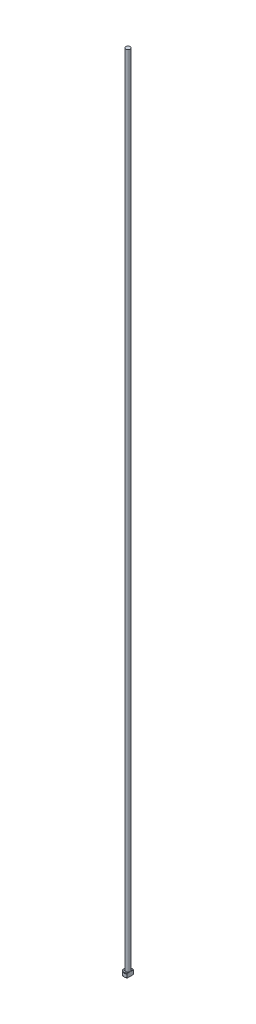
ISO-10303-21;
HEADER;
FILE_DESCRIPTION(('STEP AP214'),'2;1');
FILE_NAME('part.step','',(''),(''),'','','');
FILE_SCHEMA(('AUTOMOTIVE_DESIGN { 1 0 10303 214 1 1 1 1 }'));
ENDSEC;
DATA;
#1=APPLICATION_CONTEXT('core data for automotive mechanical design processes');
#2=APPLICATION_PROTOCOL_DEFINITION('international standard','automotive_design',2000,#1);
#3=PRODUCT_CONTEXT('',#1,'mechanical');
#4=PRODUCT('Part','Part','',(#3));
#5=PRODUCT_RELATED_PRODUCT_CATEGORY('part','',(#4));
#6=PRODUCT_DEFINITION_FORMATION('','',#4);
#7=PRODUCT_DEFINITION_CONTEXT('part definition',#1,'design');
#8=PRODUCT_DEFINITION('design','',#6,#7);
#9=PRODUCT_DEFINITION_SHAPE('','',#8);
#10=(LENGTH_UNIT() NAMED_UNIT(*) SI_UNIT(.MILLI.,.METRE.));
#11=(NAMED_UNIT(*) PLANE_ANGLE_UNIT() SI_UNIT($,.RADIAN.));
#12=(NAMED_UNIT(*) SI_UNIT($,.STERADIAN.) SOLID_ANGLE_UNIT());
#13=UNCERTAINTY_MEASURE_WITH_UNIT(LENGTH_MEASURE(1.E-05),#10,'distance_accuracy_value','');
#14=(GEOMETRIC_REPRESENTATION_CONTEXT(3) GLOBAL_UNCERTAINTY_ASSIGNED_CONTEXT((#13)) GLOBAL_UNIT_ASSIGNED_CONTEXT((#10,
#11,#12)) REPRESENTATION_CONTEXT('',''));
#15=CARTESIAN_POINT('',(0.,0.,0.));
#16=DIRECTION('',(0.,0.,1.));
#17=DIRECTION('',(1.,0.,0.));
#18=AXIS2_PLACEMENT_3D('',#15,#16,#17);
#19=CARTESIAN_POINT('',(0.,0.,0.));
#20=DIRECTION('',(0.,-1.,0.));
#21=DIRECTION('',(0.,0.,-1.));
#22=AXIS2_PLACEMENT_3D('',#19,#20,#21);
#23=PLANE('',#22);
#24=CARTESIAN_POINT('',(0.,0.,0.));
#25=DIRECTION('',(0.,-1.,0.));
#26=DIRECTION('',(0.,0.,-1.));
#27=AXIS2_PLACEMENT_3D('',#24,#25,#26);
#28=CIRCLE('',#27,1.80000000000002);
#29=CARTESIAN_POINT('',(1.09999999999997,0.,1.42478068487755));
#30=VERTEX_POINT('',#29);
#31=CARTESIAN_POINT('',(1.09999999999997,0.,-1.42478068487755));
#32=VERTEX_POINT('',#31);
#33=EDGE_CURVE('E98',#30,#32,#28,.T.);
#34=ORIENTED_EDGE('',*,*,#33,.T.);
#35=DIRECTION('',(0.,0.,1.));
#36=VECTOR('',#35,1.);
#37=CARTESIAN_POINT('',(1.09999999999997,0.,-1.67032930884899));
#38=LINE('',#37,#36);
#39=EDGE_CURVE('E83',#32,#30,#38,.T.);
#40=ORIENTED_EDGE('',*,*,#39,.T.);
#41=EDGE_LOOP('',(#34,#40));
#42=FACE_BOUND('',#41,.T.);
#43=ADVANCED_FACE('F32',(#42),#23,.T.);
#44=CARTESIAN_POINT('',(0.,259.958771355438,0.));
#45=DIRECTION('',(0.,1.,0.));
#46=DIRECTION('',(0.,0.,1.));
#47=AXIS2_PLACEMENT_3D('',#44,#45,#46);
#48=CYLINDRICAL_SURFACE('',#47,1.99999999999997);
#49=CARTESIAN_POINT('',(0.,1.79999999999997,0.));
#50=DIRECTION('',(0.,1.,0.));
#51=DIRECTION('',(0.,0.,1.));
#52=AXIS2_PLACEMENT_3D('',#49,#50,#51);
#53=CIRCLE('',#52,1.99999999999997);
#54=CARTESIAN_POINT('',(1.09999999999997,1.79999999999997,1.67032930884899));
#55=VERTEX_POINT('',#54);
#56=CARTESIAN_POINT('',(1.09999999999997,1.79999999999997,-1.67032930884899));
#57=VERTEX_POINT('',#56);
#58=EDGE_CURVE('E104',#55,#57,#53,.F.);
#59=ORIENTED_EDGE('',*,*,#58,.T.);
#60=DIRECTION('',(0.,-1.,0.));
#61=VECTOR('',#60,1.);
#62=CARTESIAN_POINT('',(1.09999999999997,400.,-1.67032930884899));
#63=LINE('',#62,#61);
#64=CARTESIAN_POINT('',(1.09999999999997,0.199999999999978,-1.67032930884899));
#65=VERTEX_POINT('',#64);
#66=EDGE_CURVE('E183',#57,#65,#63,.T.);
#67=ORIENTED_EDGE('',*,*,#66,.T.);
#68=CARTESIAN_POINT('',(0.,0.199999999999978,0.));
#69=DIRECTION('',(0.,-1.,0.));
#70=DIRECTION('',(0.,0.,-1.));
#71=AXIS2_PLACEMENT_3D('',#68,#69,#70);
#72=CIRCLE('',#71,1.99999999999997);
#73=CARTESIAN_POINT('',(1.09999999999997,0.199999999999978,1.67032930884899));
#74=VERTEX_POINT('',#73);
#75=EDGE_CURVE('E100',#65,#74,#72,.F.);
#76=ORIENTED_EDGE('',*,*,#75,.T.);
#77=DIRECTION('',(0.,-1.,0.));
#78=VECTOR('',#77,1.);
#79=CARTESIAN_POINT('',(1.09999999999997,400.,1.67032930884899));
#80=LINE('',#79,#78);
#81=EDGE_CURVE('E93',#55,#74,#80,.T.);
#82=ORIENTED_EDGE('',*,*,#81,.F.);
#83=EDGE_LOOP('',(#59,#67,#76,#82));
#84=FACE_BOUND('',#83,.T.);
#85=ADVANCED_FACE('F158',(#84),#48,.T.);
#86=CARTESIAN_POINT('',(-1.99999999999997,2.,0.));
#87=DIRECTION('',(0.,1.,0.));
#88=DIRECTION('',(0.,0.,1.));
#89=AXIS2_PLACEMENT_3D('',#86,#87,#88);
#90=PLANE('',#89);
#91=CARTESIAN_POINT('',(0.,2.,0.));
#92=DIRECTION('',(0.,1.,0.));
#93=DIRECTION('',(0.,0.,1.));
#94=AXIS2_PLACEMENT_3D('',#91,#92,#93);
#95=CIRCLE('',#94,1.79999999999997);
#96=CARTESIAN_POINT('',(1.09999999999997,2.,-1.42478068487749));
#97=VERTEX_POINT('',#96);
#98=CARTESIAN_POINT('',(1.09999999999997,2.,1.42478068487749));
#99=VERTEX_POINT('',#98);
#100=EDGE_CURVE('E178',#97,#99,#95,.T.);
#101=ORIENTED_EDGE('',*,*,#100,.T.);
#102=DIRECTION('',(0.,0.,-1.));
#103=VECTOR('',#102,1.);
#104=CARTESIAN_POINT('',(1.09999999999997,2.,0.));
#105=LINE('',#104,#103);
#106=CARTESIAN_POINT('',(1.09999999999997,1.99999999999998,0.692820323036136));
#107=VERTEX_POINT('',#106);
#108=EDGE_CURVE('E57',#99,#107,#105,.T.);
#109=ORIENTED_EDGE('',*,*,#108,.T.);
#110=CARTESIAN_POINT('',(0.,2.,0.));
#111=DIRECTION('',(0.,1.,0.));
#112=DIRECTION('',(0.,0.,1.));
#113=AXIS2_PLACEMENT_3D('',#110,#111,#112);
#114=CIRCLE('',#113,1.29999999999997);
#115=CARTESIAN_POINT('',(1.09999999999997,1.99999999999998,-0.692820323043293));
#116=VERTEX_POINT('',#115);
#117=EDGE_CURVE('E107',#107,#116,#114,.F.);
#118=ORIENTED_EDGE('',*,*,#117,.T.);
#119=EDGE_CURVE('E136',#116,#97,#105,.T.);
#120=ORIENTED_EDGE('',*,*,#119,.T.);
#121=EDGE_LOOP('',(#101,#109,#118,#120));
#122=FACE_BOUND('',#121,.T.);
#123=ADVANCED_FACE('F147',(#122),#90,.T.);
#124=CARTESIAN_POINT('',(0.,2.,0.));
#125=DIRECTION('',(0.,-1.,0.));
#126=DIRECTION('',(0.,0.,-1.));
#127=AXIS2_PLACEMENT_3D('',#124,#125,#126);
#128=CONICAL_SURFACE('',#127,1.79999999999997,0.785398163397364);
#129=ORIENTED_EDGE('',*,*,#58,.F.);
#130=CARTESIAN_POINT('',(1.09999999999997,-0.0394609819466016,3.67851337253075));
#131=CARTESIAN_POINT('',(1.09999999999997,0.0938871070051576,3.53927086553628));
#132=CARTESIAN_POINT('',(1.09999999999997,0.226969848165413,3.39976850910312));
#133=CARTESIAN_POINT('',(1.09999999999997,0.492235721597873,3.11984283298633));
#134=CARTESIAN_POINT('',(1.09999999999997,0.624418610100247,2.97941928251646));
#135=CARTESIAN_POINT('',(1.09999999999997,0.887405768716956,2.69736523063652));
#136=CARTESIAN_POINT('',(1.09999999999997,1.01821044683,2.55573511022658));
#137=CARTESIAN_POINT('',(1.09999999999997,1.27771059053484,2.27057337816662));
#138=CARTESIAN_POINT('',(1.09999999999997,1.40640632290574,2.12704201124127));
#139=CARTESIAN_POINT('',(1.09999999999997,1.59274008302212,1.91391242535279));
#140=CARTESIAN_POINT('',(1.09999999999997,1.6517969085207,1.84555665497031));
#141=CARTESIAN_POINT('',(1.09999999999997,1.7688312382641,1.70791335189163));
#142=CARTESIAN_POINT('',(1.09999999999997,1.82680864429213,1.63862573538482));
#143=CARTESIAN_POINT('',(1.09999999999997,1.94139081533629,1.49868129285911));
#144=CARTESIAN_POINT('',(1.09999999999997,1.99799249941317,1.42802193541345));
#145=CARTESIAN_POINT('',(1.09999999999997,2.10905321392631,1.28504453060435));
#146=CARTESIAN_POINT('',(1.09999999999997,2.16351265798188,1.21272680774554));
#147=CARTESIAN_POINT('',(1.09999999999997,2.25351962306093,1.08760351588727));
#148=CARTESIAN_POINT('',(1.09999999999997,2.28987864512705,1.03538457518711));
#149=CARTESIAN_POINT('',(1.09999999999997,2.36041465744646,0.929499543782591));
#150=CARTESIAN_POINT('',(1.09999999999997,2.39459216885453,0.875833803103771));
#151=CARTESIAN_POINT('',(1.09999999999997,2.45984644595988,0.766757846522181));
#152=CARTESIAN_POINT('',(1.09999999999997,2.49092891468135,0.711351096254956));
#153=CARTESIAN_POINT('',(1.09999999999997,2.54873716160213,0.598347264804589));
#154=CARTESIAN_POINT('',(1.09999999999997,2.57546692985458,0.540752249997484));
#155=CARTESIAN_POINT('',(1.09999999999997,2.6253167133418,0.416467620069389));
#156=CARTESIAN_POINT('',(1.09999999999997,2.6477191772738,0.349473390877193));
#157=CARTESIAN_POINT('',(1.09999999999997,2.67308404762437,0.247046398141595));
#158=CARTESIAN_POINT('',(1.09999999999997,2.68016204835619,0.212626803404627));
#159=CARTESIAN_POINT('',(1.09999999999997,2.69123178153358,0.143302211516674));
#160=CARTESIAN_POINT('',(1.09999999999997,2.69522514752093,0.108397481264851));
#161=CARTESIAN_POINT('',(1.09999999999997,2.69990666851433,0.0380394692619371));
#162=CARTESIAN_POINT('',(1.09999999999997,2.70056409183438,0.00258409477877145));
#163=CARTESIAN_POINT('',(1.09999999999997,2.69845711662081,-0.0682167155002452));
#164=CARTESIAN_POINT('',(1.09999999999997,2.69569269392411,-0.103562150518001));
#165=CARTESIAN_POINT('',(1.09999999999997,2.68246916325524,-0.209100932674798));
#166=CARTESIAN_POINT('',(1.09999999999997,2.66707429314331,-0.278705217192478));
#167=CARTESIAN_POINT('',(1.09999999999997,2.6311290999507,-0.398409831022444));
#168=CARTESIAN_POINT('',(1.09999999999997,2.61268926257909,-0.44919688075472));
#169=CARTESIAN_POINT('',(1.09999999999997,2.57144771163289,-0.548998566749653));
#170=CARTESIAN_POINT('',(1.09999999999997,2.54864260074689,-0.5980117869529));
#171=CARTESIAN_POINT('',(1.09999999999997,2.49970814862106,-0.694626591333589));
#172=CARTESIAN_POINT('',(1.09999999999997,2.47356275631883,-0.742219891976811));
#173=CARTESIAN_POINT('',(1.09999999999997,2.41890398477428,-0.835986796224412));
#174=CARTESIAN_POINT('',(1.09999999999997,2.3903915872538,-0.882160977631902));
#175=CARTESIAN_POINT('',(1.09999999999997,2.32625511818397,-0.981643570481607));
#176=CARTESIAN_POINT('',(1.09999999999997,2.29028006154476,-1.0347242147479));
#177=CARTESIAN_POINT('',(1.09999999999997,2.21653305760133,-1.13962743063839));
#178=CARTESIAN_POINT('',(1.09999999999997,2.17876074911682,-1.19144974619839));
#179=CARTESIAN_POINT('',(1.09999999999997,2.06341857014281,-1.34551007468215));
#180=CARTESIAN_POINT('',(1.09999999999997,1.98387469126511,-1.44626517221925));
#181=CARTESIAN_POINT('',(1.09999999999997,1.82152847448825,-1.64549240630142));
#182=CARTESIAN_POINT('',(1.09999999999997,1.73871851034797,-1.74395822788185));
#183=CARTESIAN_POINT('',(1.09999999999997,1.57115072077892,-1.93914128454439));
#184=CARTESIAN_POINT('',(1.09999999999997,1.48639373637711,-2.03585924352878));
#185=CARTESIAN_POINT('',(1.09999999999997,1.31545903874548,-2.22820182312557));
#186=CARTESIAN_POINT('',(1.09999999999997,1.22927997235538,-2.32382523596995));
#187=CARTESIAN_POINT('',(1.09999999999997,1.05596320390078,-2.51421569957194));
#188=CARTESIAN_POINT('',(1.09999999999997,0.968825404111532,-2.60898266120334));
#189=CARTESIAN_POINT('',(1.09999999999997,0.706597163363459,-2.89210208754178));
#190=CARTESIAN_POINT('',(1.09999999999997,0.530482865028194,-3.0795054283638));
#191=CARTESIAN_POINT('',(1.09999999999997,0.288219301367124,-3.33512571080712));
#192=CARTESIAN_POINT('',(1.09999999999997,0.222748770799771,-3.40399021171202));
#193=CARTESIAN_POINT('',(1.09999999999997,0.0917246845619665,-3.54143252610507));
#194=CARTESIAN_POINT('',(1.09999999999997,0.026171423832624,-3.61001062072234));
#195=CARTESIAN_POINT('',(1.09999999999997,-0.0394609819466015,-3.67851337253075));
#196=B_SPLINE_CURVE_WITH_KNOTS('',3,(#130,#131,#132,#133,#134,#135,#136,#137,#138,#139,#140,
#141,#142,#143,#144,#145,#146,#147,#148,#149,#150,#151,#152,#153,#154,#155,#156,#157,#158,#159,
#160,#161,#162,#163,#164,#165,#166,#167,#168,#169,#170,#171,#172,#173,#174,#175,#176,#177,#178,
#179,#180,#181,#182,#183,#184,#185,#186,#187,#188,#189,#190,#191,#192,#193,#194,#195),
.UNSPECIFIED.,.F.,.F.,(4,2,2,2,2,2,2,2,2,2,2,2,2,2,2,2,2,2,2,2,2,2,2,2,2,2,2,2,2,2,2,2,4),(0.,
0.578393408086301,1.1569377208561,1.73530565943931,2.31359986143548,2.58459381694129,
2.8556123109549,3.12719032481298,3.39871564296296,3.58956709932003,3.78037278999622,
3.97082012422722,4.1610918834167,4.37223430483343,4.47753596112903,4.58278181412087,
4.68899548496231,4.7952099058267,5.00790932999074,5.16979123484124,5.33179964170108,
5.49461809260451,5.65736934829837,5.84968611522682,6.04204169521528,6.42702818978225,
6.8129740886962,7.19875629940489,7.58492959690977,7.97114262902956,8.74263124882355,
9.0276899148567,9.31229787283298),.UNSPECIFIED.);
#197=EDGE_CURVE('E135',#55,#99,#196,.T.);
#198=ORIENTED_EDGE('',*,*,#197,.T.);
#199=ORIENTED_EDGE('',*,*,#100,.F.);
#200=EDGE_CURVE('E127',#97,#57,#196,.T.);
#201=ORIENTED_EDGE('',*,*,#200,.T.);
#202=EDGE_LOOP('',(#129,#198,#199,#201));
#203=FACE_BOUND('',#202,.T.);
#204=ADVANCED_FACE('F143',(#203),#128,.T.);
#205=CARTESIAN_POINT('',(0.,0.199999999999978,0.));
#206=DIRECTION('',(0.,1.,0.));
#207=DIRECTION('',(0.,0.,1.));
#208=AXIS2_PLACEMENT_3D('',#205,#206,#207);
#209=CONICAL_SURFACE('',#208,1.99999999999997,0.785398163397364);
#210=ORIENTED_EDGE('',*,*,#75,.F.);
#211=CARTESIAN_POINT('',(1.09999999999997,2.03946098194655,-3.67851337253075));
#212=CARTESIAN_POINT('',(1.09999999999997,1.90611289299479,-3.53927086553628));
#213=CARTESIAN_POINT('',(1.09999999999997,1.77303015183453,-3.39976850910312));
#214=CARTESIAN_POINT('',(1.09999999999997,1.50776427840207,-3.11984283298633));
#215=CARTESIAN_POINT('',(1.09999999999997,1.3755813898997,-2.97941928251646));
#216=CARTESIAN_POINT('',(1.09999999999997,1.11259423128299,-2.69736523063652));
#217=CARTESIAN_POINT('',(1.09999999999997,0.981789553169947,-2.55573511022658));
#218=CARTESIAN_POINT('',(1.09999999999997,0.722289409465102,-2.27057337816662));
#219=CARTESIAN_POINT('',(1.09999999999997,0.593593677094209,-2.12704201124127));
#220=CARTESIAN_POINT('',(1.09999999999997,0.407259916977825,-1.91391242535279));
#221=CARTESIAN_POINT('',(1.09999999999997,0.348203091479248,-1.84555665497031));
#222=CARTESIAN_POINT('',(1.09999999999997,0.231168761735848,-1.70791335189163));
#223=CARTESIAN_POINT('',(1.09999999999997,0.173191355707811,-1.63862573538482));
#224=CARTESIAN_POINT('',(1.09999999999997,0.058609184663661,-1.49868129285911));
#225=CARTESIAN_POINT('',(1.09999999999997,0.00200750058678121,-1.42802193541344));
#226=CARTESIAN_POINT('',(1.09999999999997,-0.109053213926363,-1.28504453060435));
#227=CARTESIAN_POINT('',(1.09999999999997,-0.16351265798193,-1.21272680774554));
#228=CARTESIAN_POINT('',(1.09999999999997,-0.253519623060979,-1.08760351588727));
#229=CARTESIAN_POINT('',(1.09999999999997,-0.289878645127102,-1.03538457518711));
#230=CARTESIAN_POINT('',(1.09999999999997,-0.360414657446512,-0.929499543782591));
#231=CARTESIAN_POINT('',(1.09999999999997,-0.394592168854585,-0.875833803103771));
#232=CARTESIAN_POINT('',(1.09999999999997,-0.45984644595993,-0.766757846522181));
#233=CARTESIAN_POINT('',(1.09999999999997,-0.4909289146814,-0.711351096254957));
#234=CARTESIAN_POINT('',(1.09999999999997,-0.548737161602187,-0.59834726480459));
#235=CARTESIAN_POINT('',(1.09999999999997,-0.575466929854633,-0.540752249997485));
#236=CARTESIAN_POINT('',(1.09999999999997,-0.625316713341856,-0.41646762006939));
#237=CARTESIAN_POINT('',(1.09999999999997,-0.647719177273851,-0.349473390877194));
#238=CARTESIAN_POINT('',(1.09999999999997,-0.673084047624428,-0.247046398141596));
#239=CARTESIAN_POINT('',(1.09999999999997,-0.680162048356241,-0.212626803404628));
#240=CARTESIAN_POINT('',(1.09999999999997,-0.691231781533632,-0.143302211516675));
#241=CARTESIAN_POINT('',(1.09999999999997,-0.69522514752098,-0.108397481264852));
#242=CARTESIAN_POINT('',(1.09999999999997,-0.699906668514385,-0.0380394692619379));
#243=CARTESIAN_POINT('',(1.09999999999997,-0.700564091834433,-0.00258409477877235));
#244=CARTESIAN_POINT('',(1.09999999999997,-0.69845711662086,0.0682167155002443));
#245=CARTESIAN_POINT('',(1.09999999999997,-0.695692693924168,0.103562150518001));
#246=CARTESIAN_POINT('',(1.09999999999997,-0.682469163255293,0.209100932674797));
#247=CARTESIAN_POINT('',(1.09999999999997,-0.667074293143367,0.278705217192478));
#248=CARTESIAN_POINT('',(1.09999999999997,-0.631129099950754,0.398409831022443));
#249=CARTESIAN_POINT('',(1.09999999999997,-0.612689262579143,0.449196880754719));
#250=CARTESIAN_POINT('',(1.09999999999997,-0.571447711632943,0.548998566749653));
#251=CARTESIAN_POINT('',(1.09999999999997,-0.548642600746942,0.5980117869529));
#252=CARTESIAN_POINT('',(1.09999999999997,-0.499708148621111,0.694626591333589));
#253=CARTESIAN_POINT('',(1.09999999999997,-0.473562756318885,0.74221989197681));
#254=CARTESIAN_POINT('',(1.09999999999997,-0.418903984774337,0.83598679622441));
#255=CARTESIAN_POINT('',(1.09999999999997,-0.390391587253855,0.8821609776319));
#256=CARTESIAN_POINT('',(1.09999999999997,-0.32625511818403,0.981643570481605));
#257=CARTESIAN_POINT('',(1.09999999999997,-0.290280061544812,1.0347242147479));
#258=CARTESIAN_POINT('',(1.09999999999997,-0.216533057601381,1.13962743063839));
#259=CARTESIAN_POINT('',(1.09999999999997,-0.178760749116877,1.19144974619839));
#260=CARTESIAN_POINT('',(1.09999999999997,-0.0634185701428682,1.34551007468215));
#261=CARTESIAN_POINT('',(1.09999999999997,0.0161253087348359,1.44626517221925));
#262=CARTESIAN_POINT('',(1.09999999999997,0.178471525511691,1.64549240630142));
#263=CARTESIAN_POINT('',(1.09999999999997,0.261281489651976,1.74395822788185));
#264=CARTESIAN_POINT('',(1.09999999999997,0.428849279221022,1.93914128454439));
#265=CARTESIAN_POINT('',(1.09999999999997,0.513606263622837,2.03585924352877));
#266=CARTESIAN_POINT('',(1.09999999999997,0.684540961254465,2.22820182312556));
#267=CARTESIAN_POINT('',(1.09999999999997,0.770720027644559,2.32382523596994));
#268=CARTESIAN_POINT('',(1.09999999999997,0.944036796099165,2.51421569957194));
#269=CARTESIAN_POINT('',(1.09999999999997,1.03117459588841,2.60898266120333));
#270=CARTESIAN_POINT('',(1.09999999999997,1.29340283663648,2.89210208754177));
#271=CARTESIAN_POINT('',(1.09999999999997,1.46951713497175,3.07950542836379));
#272=CARTESIAN_POINT('',(1.09999999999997,1.71178069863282,3.33512571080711));
#273=CARTESIAN_POINT('',(1.09999999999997,1.77725122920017,3.40399021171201));
#274=CARTESIAN_POINT('',(1.09999999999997,1.90827531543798,3.54143252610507));
#275=CARTESIAN_POINT('',(1.09999999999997,1.97382857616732,3.61001062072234));
#276=CARTESIAN_POINT('',(1.09999999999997,2.03946098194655,3.67851337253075));
#277=B_SPLINE_CURVE_WITH_KNOTS('',3,(#211,#212,#213,#214,#215,#216,#217,#218,#219,#220,#221,
#222,#223,#224,#225,#226,#227,#228,#229,#230,#231,#232,#233,#234,#235,#236,#237,#238,#239,#240,
#241,#242,#243,#244,#245,#246,#247,#248,#249,#250,#251,#252,#253,#254,#255,#256,#257,#258,#259,
#260,#261,#262,#263,#264,#265,#266,#267,#268,#269,#270,#271,#272,#273,#274,#275,#276),
.UNSPECIFIED.,.F.,.F.,(4,2,2,2,2,2,2,2,2,2,2,2,2,2,2,2,2,2,2,2,2,2,2,2,2,2,2,2,2,2,2,2,4),(0.,
0.578393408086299,1.1569377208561,1.73530565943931,2.31359986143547,2.58459381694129,
2.8556123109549,3.12719032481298,3.39871564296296,3.58956709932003,3.78037278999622,
3.97082012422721,4.1610918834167,4.37223430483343,4.47753596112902,4.58278181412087,
4.6889954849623,4.79520990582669,5.00790932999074,5.16979123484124,5.33179964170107,
5.4946180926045,5.65736934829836,5.84968611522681,6.04204169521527,6.42702818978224,
6.81297408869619,7.19875629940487,7.58492959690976,7.97114262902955,8.74263124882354,
9.02768991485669,9.31229787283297),.UNSPECIFIED.);
#278=EDGE_CURVE('E86',#65,#32,#277,.T.);
#279=ORIENTED_EDGE('',*,*,#278,.T.);
#280=ORIENTED_EDGE('',*,*,#33,.F.);
#281=EDGE_CURVE('E89',#30,#74,#277,.T.);
#282=ORIENTED_EDGE('',*,*,#281,.T.);
#283=EDGE_LOOP('',(#210,#279,#280,#282));
#284=FACE_BOUND('',#283,.T.);
#285=ADVANCED_FACE('F97',(#284),#209,.T.);
#286=CARTESIAN_POINT('',(0.,2.19999999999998,0.));
#287=DIRECTION('',(0.,1.,0.));
#288=DIRECTION('',(0.,0.,1.));
#289=AXIS2_PLACEMENT_3D('',#286,#287,#288);
#290=TOROIDAL_SURFACE('',#289,1.29999999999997,0.2);
#291=CARTESIAN_POINT('',(1.09999999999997,2.19999999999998,0.));
#292=CARTESIAN_POINT('',(1.09999999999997,2.20000051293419,3.6073967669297E-11));
#293=CARTESIAN_POINT('',(1.09999999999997,2.20000102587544,-9.99111383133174E-08));
#294=CARTESIAN_POINT('',(1.09999999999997,2.20000201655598,-4.21307805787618E-07));
#295=CARTESIAN_POINT('',(1.09999999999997,2.20000249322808,-6.45471450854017E-07));
#296=CARTESIAN_POINT('',(1.09999999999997,2.20000344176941,-1.18549609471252E-06));
#297=CARTESIAN_POINT('',(1.09999999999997,2.20000391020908,-1.50725452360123E-06));
#298=CARTESIAN_POINT('',(1.09999999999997,2.20000479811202,-2.20431303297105E-06));
#299=CARTESIAN_POINT('',(1.09999999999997,2.20000521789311,-2.5792253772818E-06));
#300=CARTESIAN_POINT('',(1.09999999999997,2.2000066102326,-3.91337800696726E-06));
#301=CARTESIAN_POINT('',(1.09999999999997,2.20000751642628,-4.94273423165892E-06));
#302=CARTESIAN_POINT('',(1.09999999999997,2.20000914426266,-7.08045055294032E-06));
#303=CARTESIAN_POINT('',(1.09999999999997,2.20000987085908,-8.18525581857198E-06));
#304=CARTESIAN_POINT('',(1.09999999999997,2.20001256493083,-1.24548986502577E-05));
#305=CARTESIAN_POINT('',(1.09999999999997,2.20001438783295,-1.57147536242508E-05));
#306=CARTESIAN_POINT('',(1.09999999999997,2.20001740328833,-2.21764542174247E-05));
#307=CARTESIAN_POINT('',(1.09999999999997,2.20001863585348,-2.53602841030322E-05));
#308=CARTESIAN_POINT('',(1.09999999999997,2.20002381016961,-3.88057522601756E-05));
#309=CARTESIAN_POINT('',(1.09999999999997,2.20002769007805,-4.90846952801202E-05));
#310=CARTESIAN_POINT('',(1.09999999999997,2.20003398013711,-6.83950902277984E-05));
#311=CARTESIAN_POINT('',(1.09999999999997,2.2000365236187,-7.73813874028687E-05));
#312=CARTESIAN_POINT('',(1.09999999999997,2.20005650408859,-0.000142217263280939));
#313=CARTESIAN_POINT('',(1.09999999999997,2.2000817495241,-0.000195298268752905));
#314=CARTESIAN_POINT('',(1.09999999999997,2.20017599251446,-0.00040106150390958));
#315=CARTESIAN_POINT('',(1.09999999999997,2.20023918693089,-0.000555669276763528));
#316=CARTESIAN_POINT('',(1.09999999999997,2.20048725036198,-0.00115356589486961));
#317=CARTESIAN_POINT('',(1.09999999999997,2.20067820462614,-0.00159487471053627));
#318=CARTESIAN_POINT('',(1.09999999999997,2.20145114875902,-0.00338993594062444));
#319=CARTESIAN_POINT('',(1.09999999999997,2.20202628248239,-0.00474587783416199));
#320=CARTESIAN_POINT('',(1.09999999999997,2.20972642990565,-0.0228890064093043));
#321=CARTESIAN_POINT('',(1.09999999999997,2.21689763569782,-0.0396618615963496));
#322=CARTESIAN_POINT('',(1.09999999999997,2.23088776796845,-0.0726432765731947));
#323=CARTESIAN_POINT('',(1.09999999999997,2.23771010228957,-0.0888504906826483));
#324=CARTESIAN_POINT('',(1.09999999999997,2.2520105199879,-0.12316170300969));
#325=CARTESIAN_POINT('',(1.09999999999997,2.25947482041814,-0.141271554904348));
#326=CARTESIAN_POINT('',(1.09999999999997,2.27424285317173,-0.177765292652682));
#327=CARTESIAN_POINT('',(1.09999999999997,2.28154426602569,-0.196150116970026));
#328=CARTESIAN_POINT('',(1.09999999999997,2.29932484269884,-0.242089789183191));
#329=CARTESIAN_POINT('',(1.09999999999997,2.30960714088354,-0.269721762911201));
#330=CARTESIAN_POINT('',(1.09999999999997,2.32891385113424,-0.324725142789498));
#331=CARTESIAN_POINT('',(1.09999999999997,2.33796145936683,-0.352088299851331));
#332=CARTESIAN_POINT('',(1.09999999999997,2.35364474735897,-0.40369058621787));
#333=CARTESIAN_POINT('',(1.09999999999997,2.36044093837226,-0.427880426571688));
#334=CARTESIAN_POINT('',(1.09999999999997,2.37278398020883,-0.47674569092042));
#335=CARTESIAN_POINT('',(1.09999999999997,2.37832261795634,-0.501423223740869));
#336=CARTESIAN_POINT('',(1.09999999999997,2.38801040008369,-0.552403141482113));
#337=CARTESIAN_POINT('',(1.09999999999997,2.39207120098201,-0.578722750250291));
#338=CARTESIAN_POINT('',(1.09999999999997,2.39789224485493,-0.631611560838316));
#339=CARTESIAN_POINT('',(1.09999999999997,2.39965448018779,-0.658180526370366));
#340=CARTESIAN_POINT('',(1.09999999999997,2.40018565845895,-0.705278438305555));
#341=CARTESIAN_POINT('',(1.09999999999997,2.39954710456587,-0.725798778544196));
#342=CARTESIAN_POINT('',(1.09999999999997,2.39616992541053,-0.766506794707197));
#343=CARTESIAN_POINT('',(1.09999999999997,2.39344923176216,-0.786695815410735));
#344=CARTESIAN_POINT('',(1.09999999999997,2.38541819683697,-0.826869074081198));
#345=CARTESIAN_POINT('',(1.09999999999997,2.38007173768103,-0.846846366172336));
#346=CARTESIAN_POINT('',(1.09999999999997,2.36615936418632,-0.885705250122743));
#347=CARTESIAN_POINT('',(1.09999999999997,2.35759666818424,-0.904587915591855));
#348=CARTESIAN_POINT('',(1.09999999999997,2.3413093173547,-0.932102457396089));
#349=CARTESIAN_POINT('',(1.09999999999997,2.33493263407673,-0.94153212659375));
#350=CARTESIAN_POINT('',(1.09999999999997,2.32089802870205,-0.959389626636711));
#351=CARTESIAN_POINT('',(1.09999999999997,2.31324176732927,-0.967818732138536));
#352=CARTESIAN_POINT('',(1.09999999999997,2.29794985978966,-0.982021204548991));
#353=CARTESIAN_POINT('',(1.09999999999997,2.2905098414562,-0.988003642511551));
#354=CARTESIAN_POINT('',(1.09999999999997,2.27474667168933,-0.998671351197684));
#355=CARTESIAN_POINT('',(1.09999999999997,2.26642452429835,-1.00335807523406));
#356=CARTESIAN_POINT('',(1.09999999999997,2.25045003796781,-1.01049114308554));
#357=CARTESIAN_POINT('',(1.09999999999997,2.24290483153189,-1.01317643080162));
#358=CARTESIAN_POINT('',(1.09999999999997,2.22746947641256,-1.01724295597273));
#359=CARTESIAN_POINT('',(1.09999999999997,2.21957951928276,-1.01862490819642));
#360=CARTESIAN_POINT('',(1.09999999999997,2.20365797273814,-1.0199891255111));
#361=CARTESIAN_POINT('',(1.09999999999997,2.19562607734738,-1.01996786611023));
#362=CARTESIAN_POINT('',(1.09999999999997,2.17969084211,-1.01851853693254));
#363=CARTESIAN_POINT('',(1.09999999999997,2.1717875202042,-1.01709027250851));
#364=CARTESIAN_POINT('',(1.09999999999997,2.15661212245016,-1.01300324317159));
#365=CARTESIAN_POINT('',(1.09999999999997,2.14932759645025,-1.01038998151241));
#366=CARTESIAN_POINT('',(1.09999999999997,2.13523656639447,-1.00410166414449));
#367=CARTESIAN_POINT('',(1.09999999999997,2.12843022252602,-1.00042625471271));
#368=CARTESIAN_POINT('',(1.09999999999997,2.11281201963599,-0.990557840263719));
#369=CARTESIAN_POINT('',(1.09999999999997,2.10426616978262,-0.983943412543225));
#370=CARTESIAN_POINT('',(1.09999999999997,2.08835473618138,-0.969418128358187));
#371=CARTESIAN_POINT('',(1.09999999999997,2.08099195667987,-0.961504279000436));
#372=CARTESIAN_POINT('',(1.09999999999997,2.06451454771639,-0.941147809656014));
#373=CARTESIAN_POINT('',(1.09999999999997,2.05600335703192,-0.928218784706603));
#374=CARTESIAN_POINT('',(1.09999999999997,2.04111601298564,-0.901229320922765));
#375=CARTESIAN_POINT('',(1.09999999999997,2.03473990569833,-0.887168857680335));
#376=CARTESIAN_POINT('',(1.09999999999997,2.0205978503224,-0.849888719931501));
#377=CARTESIAN_POINT('',(1.09999999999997,2.01422029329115,-0.826146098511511));
#378=CARTESIAN_POINT('',(1.09999999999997,2.0050305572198,-0.777766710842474));
#379=CARTESIAN_POINT('',(1.09999999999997,2.00226155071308,-0.753122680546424));
#380=CARTESIAN_POINT('',(1.09999999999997,1.99848820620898,-0.682856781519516));
#381=CARTESIAN_POINT('',(1.09999999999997,2.00093637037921,-0.637054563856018));
#382=CARTESIAN_POINT('',(1.09999999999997,2.0092928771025,-0.570140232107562));
#383=CARTESIAN_POINT('',(1.09999999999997,2.01272884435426,-0.548616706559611));
#384=CARTESIAN_POINT('',(1.09999999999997,2.02080692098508,-0.505905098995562));
#385=CARTESIAN_POINT('',(1.09999999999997,2.0254425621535,-0.484715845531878));
#386=CARTESIAN_POINT('',(1.09999999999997,2.03889892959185,-0.42948239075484));
#387=CARTESIAN_POINT('',(1.09999999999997,2.04852945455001,-0.395639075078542));
#388=CARTESIAN_POINT('',(1.09999999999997,2.06989966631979,-0.327791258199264));
#389=CARTESIAN_POINT('',(1.09999999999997,2.08168242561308,-0.293800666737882));
#390=CARTESIAN_POINT('',(1.09999999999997,2.10244380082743,-0.237493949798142));
#391=CARTESIAN_POINT('',(1.09999999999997,2.11105810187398,-0.21504099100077));
#392=CARTESIAN_POINT('',(1.09999999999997,2.12862794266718,-0.170525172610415));
#393=CARTESIAN_POINT('',(1.09999999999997,2.13757927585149,-0.14846064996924));
#394=CARTESIAN_POINT('',(1.09999999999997,2.15480867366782,-0.106697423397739));
#395=CARTESIAN_POINT('',(1.09999999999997,2.16306162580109,-0.0869881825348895));
#396=CARTESIAN_POINT('',(1.09999999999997,2.18002424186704,-0.0468908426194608));
#397=CARTESIAN_POINT('',(1.09999999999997,2.18873943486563,-0.0265049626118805));
#398=CARTESIAN_POINT('',(1.09999999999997,2.19797392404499,-0.00474531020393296));
#399=CARTESIAN_POINT('',(1.09999999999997,2.19854931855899,-0.00338881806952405));
#400=CARTESIAN_POINT('',(1.09999999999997,2.1993223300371,-0.00159362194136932));
#401=CARTESIAN_POINT('',(1.09999999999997,2.19951310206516,-0.00115273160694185));
#402=CARTESIAN_POINT('',(1.09999999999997,2.19976094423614,-0.000555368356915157));
#403=CARTESIAN_POINT('',(1.09999999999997,2.19982409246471,-0.000400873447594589));
#404=CARTESIAN_POINT('',(1.09999999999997,2.19991827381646,-0.000195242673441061));
#405=CARTESIAN_POINT('',(1.09999999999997,2.19994350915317,-0.000142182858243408));
#406=CARTESIAN_POINT('',(1.09999999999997,2.19996348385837,-7.73713511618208E-05));
#407=CARTESIAN_POINT('',(1.09999999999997,2.19996602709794,-6.83867125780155E-05));
#408=CARTESIAN_POINT('',(1.09999999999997,2.19997231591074,-4.90799325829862E-05));
#409=CARTESIAN_POINT('',(1.09999999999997,2.19997619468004,-3.88029010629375E-05));
#410=CARTESIAN_POINT('',(1.09999999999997,2.19998136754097,-2.53595805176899E-05));
#411=CARTESIAN_POINT('',(1.09999999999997,2.19998259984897,-2.21760163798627E-05));
#412=CARTESIAN_POINT('',(1.09999999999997,2.19998561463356,-1.57148108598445E-05));
#413=CARTESIAN_POINT('',(1.09999999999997,2.19998743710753,-1.24551761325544E-05));
#414=CARTESIAN_POINT('',(1.09999999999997,2.19999013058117,-8.18573740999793E-06));
#415=CARTESIAN_POINT('',(1.09999999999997,2.19999085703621,-7.08095311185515E-06));
#416=CARTESIAN_POINT('',(1.09999999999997,2.19999248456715,-4.94325032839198E-06));
#417=CARTESIAN_POINT('',(1.09999999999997,2.19999339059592,-3.9138854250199E-06));
#418=CARTESIAN_POINT('',(1.09999999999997,2.19999478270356,-2.57968679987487E-06));
#419=CARTESIAN_POINT('',(1.09999999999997,2.19999520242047,-2.2047544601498E-06));
#420=CARTESIAN_POINT('',(1.09999999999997,2.1999960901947,-1.50764450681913E-06));
#421=CARTESIAN_POINT('',(1.09999999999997,2.1999965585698,-1.18585452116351E-06));
#422=CARTESIAN_POINT('',(1.09999999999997,2.19999750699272,-6.45753424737E-07));
#423=CARTESIAN_POINT('',(1.09999999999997,2.1999979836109,-4.21546286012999E-07));
#424=CARTESIAN_POINT('',(1.09999999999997,2.19999897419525,-1.00044385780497E-07));
#425=CARTESIAN_POINT('',(1.09999999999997,2.1999994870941,-3.60719752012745E-11));
#426=CARTESIAN_POINT('',(1.09999999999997,2.19999999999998,0.));
#427=B_SPLINE_CURVE_WITH_KNOTS('',3,(#291,#292,#293,#294,#295,#296,#297,#298,#299,#300,#301,
#302,#303,#304,#305,#306,#307,#308,#309,#310,#311,#312,#313,#314,#315,#316,#317,#318,#319,#320,
#321,#322,#323,#324,#325,#326,#327,#328,#329,#330,#331,#332,#333,#334,#335,#336,#337,#338,#339,
#340,#341,#342,#343,#344,#345,#346,#347,#348,#349,#350,#351,#352,#353,#354,#355,#356,#357,#358,
#359,#360,#361,#362,#363,#364,#365,#366,#367,#368,#369,#370,#371,#372,#373,#374,#375,#376,#377,
#378,#379,#380,#381,#382,#383,#384,#385,#386,#387,#388,#389,#390,#391,#392,#393,#394,#395,#396,
#397,#398,#399,#400,#401,#402,#403,#404,#405,#406,#407,#408,#409,#410,#411,#412,#413,#414,#415,
#416,#417,#418,#419,#420,#421,#422,#423,#424,#425,#426),.UNSPECIFIED.,.T.,.F.,(4,2,2,2,2,2,2,2,
2,2,2,2,2,2,2,2,2,2,2,2,2,2,2,2,2,2,2,2,2,2,2,2,2,2,2,2,2,2,2,2,2,2,2,2,2,2,2,2,2,2,2,2,2,2,2,2,
2,2,2,2,2,2,2,2,2,2,2,4),(0.,1.53757781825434E-06,3.11015844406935E-06,4.80844102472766E-06,
6.49491820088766E-06,1.05889533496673E-05,1.4552753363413E-05,2.57199109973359E-05,
3.59516089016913E-05,6.89038245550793E-05,9.68952770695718E-05,0.000272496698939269,
0.000774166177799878,0.00221597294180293,0.00663537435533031,0.0613537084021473,
0.114108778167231,0.172870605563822,0.232213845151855,0.32064861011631,0.407082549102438,
0.482434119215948,0.558264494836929,0.638080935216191,0.717828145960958,0.779333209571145,
0.840314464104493,0.902159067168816,0.963941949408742,0.998002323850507,1.03201883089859,
1.06055188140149,1.08905279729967,1.1129756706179,1.136885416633,1.16085521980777,
1.18482833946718,1.20795004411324,1.23107945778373,1.26331905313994,1.29563397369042,
1.341811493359,1.38799000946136,1.46132993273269,1.53553947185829,1.67227413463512,
1.73765429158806,1.8026890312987,1.90816998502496,2.01605526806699,2.08819695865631,
2.15962670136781,2.22373012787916,2.29023422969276,2.2946554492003,2.29609588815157,
2.29659719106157,2.29677272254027,2.29680070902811,2.29683365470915,2.2968438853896,
2.29685505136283,2.29685901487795,2.29686310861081,2.29686479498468,2.2968664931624,
2.29686806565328,2.29686960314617),.UNSPECIFIED.);
#428=CARTESIAN_POINT('',(1.09999999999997,2.19999999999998,0.));
#429=VERTEX_POINT('',#428);
#430=EDGE_CURVE('E11',#116,#429,#427,.T.);
#431=ORIENTED_EDGE('',*,*,#430,.F.);
#432=ORIENTED_EDGE('',*,*,#117,.F.);
#433=CARTESIAN_POINT('',(1.09999999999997,2.19999999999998,0.));
#434=CARTESIAN_POINT('',(1.09999999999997,2.19999948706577,-3.60741074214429E-11));
#435=CARTESIAN_POINT('',(1.09999999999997,2.19999897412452,9.99111381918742E-08));
#436=CARTESIAN_POINT('',(1.09999999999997,2.19999798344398,4.21307805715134E-07));
#437=CARTESIAN_POINT('',(1.09999999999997,2.19999750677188,6.4547145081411E-07));
#438=CARTESIAN_POINT('',(1.09999999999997,2.19999655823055,1.18549609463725E-06));
#439=CARTESIAN_POINT('',(1.09999999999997,2.19999608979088,1.50725452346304E-06));
#440=CARTESIAN_POINT('',(1.09999999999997,2.19999520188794,2.20431303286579E-06));
#441=CARTESIAN_POINT('',(1.09999999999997,2.19999478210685,2.5792253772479E-06));
#442=CARTESIAN_POINT('',(1.09999999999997,2.19999338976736,3.91337800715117E-06));
#443=CARTESIAN_POINT('',(1.09999999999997,2.19999248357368,4.9427342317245E-06));
#444=CARTESIAN_POINT('',(1.09999999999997,2.1999908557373,7.08045055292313E-06));
#445=CARTESIAN_POINT('',(1.09999999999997,2.19999012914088,8.18525581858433E-06));
#446=CARTESIAN_POINT('',(1.09999999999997,2.19998743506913,1.2454898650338E-05));
#447=CARTESIAN_POINT('',(1.09999999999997,2.19998561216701,1.57147536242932E-05));
#448=CARTESIAN_POINT('',(1.09999999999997,2.19998259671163,2.21764542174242E-05));
#449=CARTESIAN_POINT('',(1.09999999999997,2.19998136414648,2.53602841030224E-05));
#450=CARTESIAN_POINT('',(1.09999999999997,2.19997618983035,3.88057522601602E-05));
#451=CARTESIAN_POINT('',(1.09999999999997,2.19997230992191,4.90846952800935E-05));
#452=CARTESIAN_POINT('',(1.09999999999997,2.19996601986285,6.83950902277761E-05));
#453=CARTESIAN_POINT('',(1.09999999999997,2.19996347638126,7.7381387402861E-05));
#454=CARTESIAN_POINT('',(1.09999999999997,2.19994349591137,0.000142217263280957));
#455=CARTESIAN_POINT('',(1.09999999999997,2.19991825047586,0.000195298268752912));
#456=CARTESIAN_POINT('',(1.09999999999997,2.1998240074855,0.000401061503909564));
#457=CARTESIAN_POINT('',(1.09999999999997,2.19976081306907,0.000555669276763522));
#458=CARTESIAN_POINT('',(1.09999999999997,2.19951274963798,0.00115356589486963));
#459=CARTESIAN_POINT('',(1.09999999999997,2.19932179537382,0.00159487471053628));
#460=CARTESIAN_POINT('',(1.09999999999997,2.19854885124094,0.00338993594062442));
#461=CARTESIAN_POINT('',(1.09999999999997,2.19797371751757,0.00474587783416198));
#462=CARTESIAN_POINT('',(1.09999999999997,2.19027357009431,0.0228890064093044));
#463=CARTESIAN_POINT('',(1.09999999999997,2.18310236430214,0.0396618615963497));
#464=CARTESIAN_POINT('',(1.09999999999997,2.16911223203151,0.0726432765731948));
#465=CARTESIAN_POINT('',(1.09999999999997,2.16228989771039,0.0888504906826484));
#466=CARTESIAN_POINT('',(1.09999999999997,2.14798948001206,0.12316170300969));
#467=CARTESIAN_POINT('',(1.09999999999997,2.14052517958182,0.141271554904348));
#468=CARTESIAN_POINT('',(1.09999999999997,2.12575714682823,0.177765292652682));
#469=CARTESIAN_POINT('',(1.09999999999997,2.11845573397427,0.196150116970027));
#470=CARTESIAN_POINT('',(1.09999999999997,2.10067515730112,0.242089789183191));
#471=CARTESIAN_POINT('',(1.09999999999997,2.09039285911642,0.269721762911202));
#472=CARTESIAN_POINT('',(1.09999999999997,2.07108614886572,0.324725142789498));
#473=CARTESIAN_POINT('',(1.09999999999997,2.06203854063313,0.352088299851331));
#474=CARTESIAN_POINT('',(1.09999999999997,2.04635525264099,0.40369058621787));
#475=CARTESIAN_POINT('',(1.09999999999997,2.0395590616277,0.427880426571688));
#476=CARTESIAN_POINT('',(1.09999999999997,2.02721601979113,0.47674569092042));
#477=CARTESIAN_POINT('',(1.09999999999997,2.02167738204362,0.50142322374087));
#478=CARTESIAN_POINT('',(1.09999999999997,2.01198959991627,0.552403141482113));
#479=CARTESIAN_POINT('',(1.09999999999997,2.00792879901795,0.578722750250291));
#480=CARTESIAN_POINT('',(1.09999999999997,2.00210775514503,0.631611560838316));
#481=CARTESIAN_POINT('',(1.09999999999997,2.00034551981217,0.658180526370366));
#482=CARTESIAN_POINT('',(1.09999999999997,1.99981434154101,0.705278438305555));
#483=CARTESIAN_POINT('',(1.09999999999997,2.00045289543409,0.725798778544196));
#484=CARTESIAN_POINT('',(1.09999999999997,2.00383007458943,0.766506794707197));
#485=CARTESIAN_POINT('',(1.09999999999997,2.0065507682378,0.786695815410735));
#486=CARTESIAN_POINT('',(1.09999999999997,2.01458180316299,0.826869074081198));
#487=CARTESIAN_POINT('',(1.09999999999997,2.01992826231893,0.846846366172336));
#488=CARTESIAN_POINT('',(1.09999999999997,2.03384063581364,0.885705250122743));
#489=CARTESIAN_POINT('',(1.09999999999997,2.04240333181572,0.904587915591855));
#490=CARTESIAN_POINT('',(1.09999999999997,2.05869068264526,0.932102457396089));
#491=CARTESIAN_POINT('',(1.09999999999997,2.06506736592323,0.94153212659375));
#492=CARTESIAN_POINT('',(1.09999999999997,2.07910197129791,0.959389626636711));
#493=CARTESIAN_POINT('',(1.09999999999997,2.08675823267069,0.967818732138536));
#494=CARTESIAN_POINT('',(1.09999999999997,2.1020501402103,0.982021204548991));
#495=CARTESIAN_POINT('',(1.09999999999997,2.10949015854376,0.988003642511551));
#496=CARTESIAN_POINT('',(1.09999999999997,2.12525332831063,0.998671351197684));
#497=CARTESIAN_POINT('',(1.09999999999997,2.13357547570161,1.00335807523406));
#498=CARTESIAN_POINT('',(1.09999999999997,2.14954996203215,1.01049114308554));
#499=CARTESIAN_POINT('',(1.09999999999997,2.15709516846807,1.01317643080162));
#500=CARTESIAN_POINT('',(1.09999999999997,2.1725305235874,1.01724295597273));
#501=CARTESIAN_POINT('',(1.09999999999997,2.1804204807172,1.01862490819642));
#502=CARTESIAN_POINT('',(1.09999999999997,2.19634202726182,1.0199891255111));
#503=CARTESIAN_POINT('',(1.09999999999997,2.20437392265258,1.01996786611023));
#504=CARTESIAN_POINT('',(1.09999999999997,2.22030915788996,1.01851853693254));
#505=CARTESIAN_POINT('',(1.09999999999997,2.22821247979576,1.01709027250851));
#506=CARTESIAN_POINT('',(1.09999999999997,2.2433878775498,1.01300324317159));
#507=CARTESIAN_POINT('',(1.09999999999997,2.25067240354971,1.01038998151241));
#508=CARTESIAN_POINT('',(1.09999999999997,2.26476343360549,1.00410166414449));
#509=CARTESIAN_POINT('',(1.09999999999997,2.27156977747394,1.00042625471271));
#510=CARTESIAN_POINT('',(1.09999999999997,2.28718798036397,0.990557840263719));
#511=CARTESIAN_POINT('',(1.09999999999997,2.29573383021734,0.983943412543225));
#512=CARTESIAN_POINT('',(1.09999999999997,2.31164526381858,0.969418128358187));
#513=CARTESIAN_POINT('',(1.09999999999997,2.31900804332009,0.961504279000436));
#514=CARTESIAN_POINT('',(1.09999999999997,2.33548545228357,0.941147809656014));
#515=CARTESIAN_POINT('',(1.09999999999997,2.34399664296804,0.928218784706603));
#516=CARTESIAN_POINT('',(1.09999999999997,2.35888398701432,0.901229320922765));
#517=CARTESIAN_POINT('',(1.09999999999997,2.36526009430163,0.887168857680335));
#518=CARTESIAN_POINT('',(1.09999999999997,2.37940214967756,0.849888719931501));
#519=CARTESIAN_POINT('',(1.09999999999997,2.38577970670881,0.826146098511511));
#520=CARTESIAN_POINT('',(1.09999999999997,2.39496944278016,0.777766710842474));
#521=CARTESIAN_POINT('',(1.09999999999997,2.39773844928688,0.753122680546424));
#522=CARTESIAN_POINT('',(1.09999999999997,2.40151179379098,0.682856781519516));
#523=CARTESIAN_POINT('',(1.09999999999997,2.39906362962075,0.637054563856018));
#524=CARTESIAN_POINT('',(1.09999999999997,2.39070712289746,0.570140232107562));
#525=CARTESIAN_POINT('',(1.09999999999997,2.3872711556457,0.548616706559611));
#526=CARTESIAN_POINT('',(1.09999999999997,2.37919307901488,0.505905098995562));
#527=CARTESIAN_POINT('',(1.09999999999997,2.37455743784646,0.484715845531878));
#528=CARTESIAN_POINT('',(1.09999999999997,2.36110107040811,0.42948239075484));
#529=CARTESIAN_POINT('',(1.09999999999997,2.35147054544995,0.395639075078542));
#530=CARTESIAN_POINT('',(1.09999999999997,2.33010033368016,0.327791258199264));
#531=CARTESIAN_POINT('',(1.09999999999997,2.31831757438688,0.293800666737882));
#532=CARTESIAN_POINT('',(1.09999999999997,2.29755619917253,0.237493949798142));
#533=CARTESIAN_POINT('',(1.09999999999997,2.28894189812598,0.21504099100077));
#534=CARTESIAN_POINT('',(1.09999999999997,2.27137205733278,0.170525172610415));
#535=CARTESIAN_POINT('',(1.09999999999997,2.26242072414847,0.148460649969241));
#536=CARTESIAN_POINT('',(1.09999999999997,2.24519132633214,0.106697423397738));
#537=CARTESIAN_POINT('',(1.09999999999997,2.23693837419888,0.086988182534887));
#538=CARTESIAN_POINT('',(1.09999999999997,2.21997575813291,0.0468908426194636));
#539=CARTESIAN_POINT('',(1.09999999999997,2.2112605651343,0.0265049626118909));
#540=CARTESIAN_POINT('',(1.09999999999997,2.20202607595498,0.00474531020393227));
#541=CARTESIAN_POINT('',(1.09999999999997,2.20145068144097,0.00338881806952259));
#542=CARTESIAN_POINT('',(1.09999999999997,2.20067766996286,0.0015936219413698));
#543=CARTESIAN_POINT('',(1.09999999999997,2.2004868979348,0.00115273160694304));
#544=CARTESIAN_POINT('',(1.09999999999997,2.20023905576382,0.000555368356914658));
#545=CARTESIAN_POINT('',(1.09999999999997,2.20017590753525,0.00040087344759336));
#546=CARTESIAN_POINT('',(1.09999999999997,2.2000817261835,0.000195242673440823));
#547=CARTESIAN_POINT('',(1.09999999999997,2.20005649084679,0.000142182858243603));
#548=CARTESIAN_POINT('',(1.09999999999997,2.20003651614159,7.73713511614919E-05));
#549=CARTESIAN_POINT('',(1.09999999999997,2.20003397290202,6.83867125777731E-05));
#550=CARTESIAN_POINT('',(1.09999999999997,2.20002768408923,4.90799325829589E-05));
#551=CARTESIAN_POINT('',(1.09999999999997,2.20002380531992,3.88029010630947E-05));
#552=CARTESIAN_POINT('',(1.09999999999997,2.20001863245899,2.53595805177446E-05));
#553=CARTESIAN_POINT('',(1.09999999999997,2.20001740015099,2.21760163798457E-05));
#554=CARTESIAN_POINT('',(1.09999999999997,2.2000143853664,1.57148108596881E-05));
#555=CARTESIAN_POINT('',(1.09999999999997,2.20001256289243,1.24551761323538E-05));
#556=CARTESIAN_POINT('',(1.09999999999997,2.20000986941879,8.18573740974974E-06));
#557=CARTESIAN_POINT('',(1.09999999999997,2.20000914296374,7.0809531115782E-06));
#558=CARTESIAN_POINT('',(1.09999999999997,2.20000751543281,4.94325032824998E-06));
#559=CARTESIAN_POINT('',(1.09999999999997,2.20000660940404,3.91388542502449E-06));
#560=CARTESIAN_POINT('',(1.09999999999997,2.2000052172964,2.57968680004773E-06));
#561=CARTESIAN_POINT('',(1.09999999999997,2.20000479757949,2.20475446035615E-06));
#562=CARTESIAN_POINT('',(1.09999999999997,2.20000390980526,1.50764450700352E-06));
#563=CARTESIAN_POINT('',(1.09999999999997,2.20000344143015,1.18585452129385E-06));
#564=CARTESIAN_POINT('',(1.09999999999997,2.20000249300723,6.45753424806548E-07));
#565=CARTESIAN_POINT('',(1.09999999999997,2.20000201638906,4.215462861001E-07));
#566=CARTESIAN_POINT('',(1.09999999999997,2.20000102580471,1.00044385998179E-07));
#567=CARTESIAN_POINT('',(1.09999999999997,2.20000051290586,3.60721149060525E-11));
#568=CARTESIAN_POINT('',(1.09999999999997,2.19999999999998,0.));
#569=B_SPLINE_CURVE_WITH_KNOTS('',3,(#433,#434,#435,#436,#437,#438,#439,#440,#441,#442,#443,
#444,#445,#446,#447,#448,#449,#450,#451,#452,#453,#454,#455,#456,#457,#458,#459,#460,#461,#462,
#463,#464,#465,#466,#467,#468,#469,#470,#471,#472,#473,#474,#475,#476,#477,#478,#479,#480,#481,
#482,#483,#484,#485,#486,#487,#488,#489,#490,#491,#492,#493,#494,#495,#496,#497,#498,#499,#500,
#501,#502,#503,#504,#505,#506,#507,#508,#509,#510,#511,#512,#513,#514,#515,#516,#517,#518,#519,
#520,#521,#522,#523,#524,#525,#526,#527,#528,#529,#530,#531,#532,#533,#534,#535,#536,#537,#538,
#539,#540,#541,#542,#543,#544,#545,#546,#547,#548,#549,#550,#551,#552,#553,#554,#555,#556,#557,
#558,#559,#560,#561,#562,#563,#564,#565,#566,#567,#568),.UNSPECIFIED.,.T.,.F.,(4,2,2,2,2,2,2,2,
2,2,2,2,2,2,2,2,2,2,2,2,2,2,2,2,2,2,2,2,2,2,2,2,2,2,2,2,2,2,2,2,2,2,2,2,2,2,2,2,2,2,2,2,2,2,2,2,
2,2,2,2,2,2,2,2,2,2,2,4),(0.,1.53757781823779E-06,3.11015844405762E-06,4.80844102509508E-06,
6.49491820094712E-06,1.05889533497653E-05,1.45527533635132E-05,2.57199109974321E-05,
3.59516089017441E-05,6.89038245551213E-05,9.68952770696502E-05,0.000272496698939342,
0.000774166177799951,0.002215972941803,0.00663537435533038,0.0613537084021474,0.114108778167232,
0.172870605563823,0.232213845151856,0.320648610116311,0.407082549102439,0.482434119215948,
0.558264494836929,0.638080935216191,0.717828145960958,0.779333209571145,0.840314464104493,
0.902159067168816,0.963941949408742,0.998002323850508,1.03201883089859,1.06055188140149,
1.08905279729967,1.1129756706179,1.136885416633,1.16085521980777,1.18482833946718,
1.20795004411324,1.23107945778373,1.26331905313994,1.29563397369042,1.341811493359,
1.38799000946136,1.46132993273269,1.53553947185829,1.67227413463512,1.73765429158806,
1.8026890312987,1.90816998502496,2.01605526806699,2.08819695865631,2.15962670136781,
2.22373012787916,2.29023422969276,2.2946554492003,2.29609588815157,2.29659719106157,
2.29677272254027,2.29680070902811,2.29683365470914,2.2968438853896,2.29685505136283,
2.29685901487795,2.29686310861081,2.29686479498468,2.2968664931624,2.29686806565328,
2.29686960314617),.UNSPECIFIED.);
#570=EDGE_CURVE('E46',#429,#107,#569,.T.);
#571=ORIENTED_EDGE('',*,*,#570,.F.);
#572=CARTESIAN_POINT('',(0.,2.19999999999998,0.));
#573=DIRECTION('',(0.,1.,0.));
#574=DIRECTION('',(0.,0.,1.));
#575=AXIS2_PLACEMENT_3D('',#572,#573,#574);
#576=CIRCLE('',#575,1.09999999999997);
#577=EDGE_CURVE('E103',#429,#429,#576,.T.);
#578=ORIENTED_EDGE('',*,*,#577,.F.);
#579=EDGE_LOOP('',(#431,#432,#571,#578));
#580=FACE_BOUND('',#579,.T.);
#581=ADVANCED_FACE('F34',(#580),#290,.F.);
#582=CARTESIAN_POINT('',(0.,259.958771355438,0.));
#583=DIRECTION('',(0.,1.,0.));
#584=DIRECTION('',(0.,0.,1.));
#585=AXIS2_PLACEMENT_3D('',#582,#583,#584);
#586=CYLINDRICAL_SURFACE('',#585,1.09999999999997);
#587=ORIENTED_EDGE('',*,*,#577,.T.);
#588=EDGE_LOOP('',(#587));
#589=FACE_BOUND('',#588,.T.);
#590=CARTESIAN_POINT('',(0.,400.,0.));
#591=DIRECTION('',(0.,1.,0.));
#592=DIRECTION('',(0.,0.,1.));
#593=AXIS2_PLACEMENT_3D('',#590,#591,#592);
#594=CIRCLE('',#593,1.09999999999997);
#595=CARTESIAN_POINT('',(0.,400.,1.09999999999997));
#596=VERTEX_POINT('',#595);
#597=EDGE_CURVE('E101',#596,#596,#594,.T.);
#598=ORIENTED_EDGE('',*,*,#597,.F.);
#599=EDGE_LOOP('',(#598));
#600=FACE_BOUND('',#599,.T.);
#601=ADVANCED_FACE('F155',(#589,#600),#586,.T.);
#602=CARTESIAN_POINT('',(-1.09999999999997,400.,0.));
#603=DIRECTION('',(0.,1.,0.));
#604=DIRECTION('',(0.,0.,1.));
#605=AXIS2_PLACEMENT_3D('',#602,#603,#604);
#606=PLANE('',#605);
#607=ORIENTED_EDGE('',*,*,#597,.T.);
#608=EDGE_LOOP('',(#607));
#609=FACE_BOUND('',#608,.T.);
#610=ADVANCED_FACE('F121',(#609),#606,.T.);
#611=CARTESIAN_POINT('',(1.09999999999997,400.,-1.67032930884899));
#612=DIRECTION('',(1.,0.,0.));
#613=DIRECTION('',(0.,0.,-1.));
#614=AXIS2_PLACEMENT_3D('',#611,#612,#613);
#615=PLANE('',#614);
#616=ORIENTED_EDGE('',*,*,#66,.F.);
#617=ORIENTED_EDGE('',*,*,#200,.F.);
#618=ORIENTED_EDGE('',*,*,#119,.F.);
#619=ORIENTED_EDGE('',*,*,#430,.T.);
#620=ORIENTED_EDGE('',*,*,#570,.T.);
#621=ORIENTED_EDGE('',*,*,#108,.F.);
#622=ORIENTED_EDGE('',*,*,#197,.F.);
#623=ORIENTED_EDGE('',*,*,#81,.T.);
#624=ORIENTED_EDGE('',*,*,#281,.F.);
#625=ORIENTED_EDGE('',*,*,#39,.F.);
#626=ORIENTED_EDGE('',*,*,#278,.F.);
#627=EDGE_LOOP('',(#616,#617,#618,#619,#620,#621,#622,#623,#624,#625,#626));
#628=FACE_BOUND('',#627,.T.);
#629=ADVANCED_FACE('F85',(#628),#615,.T.);
#630=CLOSED_SHELL('',(#43,#85,#123,#204,#285,#581,#601,#610,#629));
#631=MANIFOLD_SOLID_BREP('B2',#630);
#632=ADVANCED_BREP_SHAPE_REPRESENTATION('',(#18,#631),#14);
#633=SHAPE_DEFINITION_REPRESENTATION(#9,#632);
ENDSEC;
END-ISO-10303-21;
